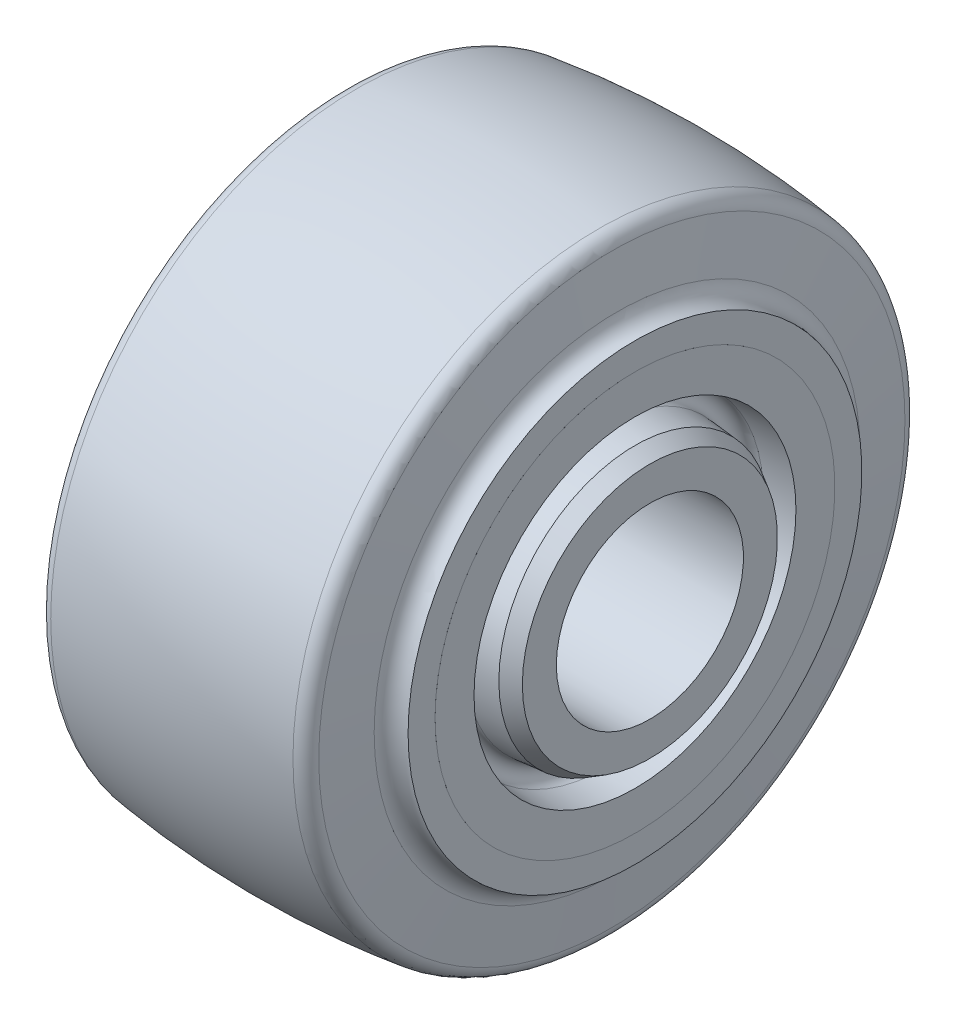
from build123d import *


with BuildPart() as part:
    # Sketch1 → Revolve1 (revolve)
    with BuildSketch(Plane.XY, mode=Mode.PRIVATE) as revolve1_sk:
        with BuildLine():
            Line((27.813, 20.6375), (25.4, 22.030646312))
            Line((25.4, 22.030646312), (20.530890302, 22.456638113))
            ThreePointArc((20.530890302, 22.456638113), (19.08175, 24.038097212), (20.530890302, 25.619556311))
            Line((20.530890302, 25.619556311), (25.4, 26.045548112))
            Line((25.4, 26.045548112), (25.4, 32.3453125))
            Line((25.4, 32.3453125), (25.39746, 32.3453125))
            Line((25.39746, 32.3453125), (25.39746, 36.7109375))
            ThreePointArc((25.39746, 36.7109375), (23.455410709, 37.456420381), (22.511012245, 39.309906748))
            Line((22.511012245, 39.309906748), (21.658367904, 47.422276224))
            ThreePointArc((21.658367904, 47.422276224), (20.994229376, 48.836650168), (19.596355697, 49.534849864))
            ThreePointArc((19.596355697, 49.534849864), (0, 50.8), (-19.596355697, 49.534849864))
            ThreePointArc((-19.596355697, 49.534849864), (-20.994229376, 48.836650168), (-21.658367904, 47.422276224))
            Line((-21.658367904, 47.422276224), (-22.511012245, 39.309906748))
            ThreePointArc((-22.511012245, 39.309906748), (-23.455410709, 37.456420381), (-25.39746, 36.7109375))
            Line((-25.39746, 36.7109375), (-25.39746, 32.3453125))
            Line((-25.39746, 32.3453125), (-25.4, 32.3453125))
            Line((-25.4, 32.3453125), (-25.4, 26.045548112))
            Line((-25.4, 26.045548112), (-20.530890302, 25.619556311))
            ThreePointArc((-20.530890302, 25.619556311), (-19.08175, 24.038097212), (-20.530890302, 22.456638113))
            Line((-20.530890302, 22.456638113), (-25.4, 22.030646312))
            Line((-25.4, 22.030646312), (-27.813, 20.6375))
            Line((-27.813, 20.6375), (-27.813, 15.1384))
            Line((-27.813, 15.1384), (27.813, 15.1384))
            Line((27.813, 15.1384), (27.813, 20.6375))
        make_face()
    revolve(revolve1_sk.sketch.rotate(Axis((-38.862204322, 0, 0), (1, 0, 0)), 90), axis=Axis((-38.862204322, 0, 0), (1, 0, 0)))


solid = part.part
